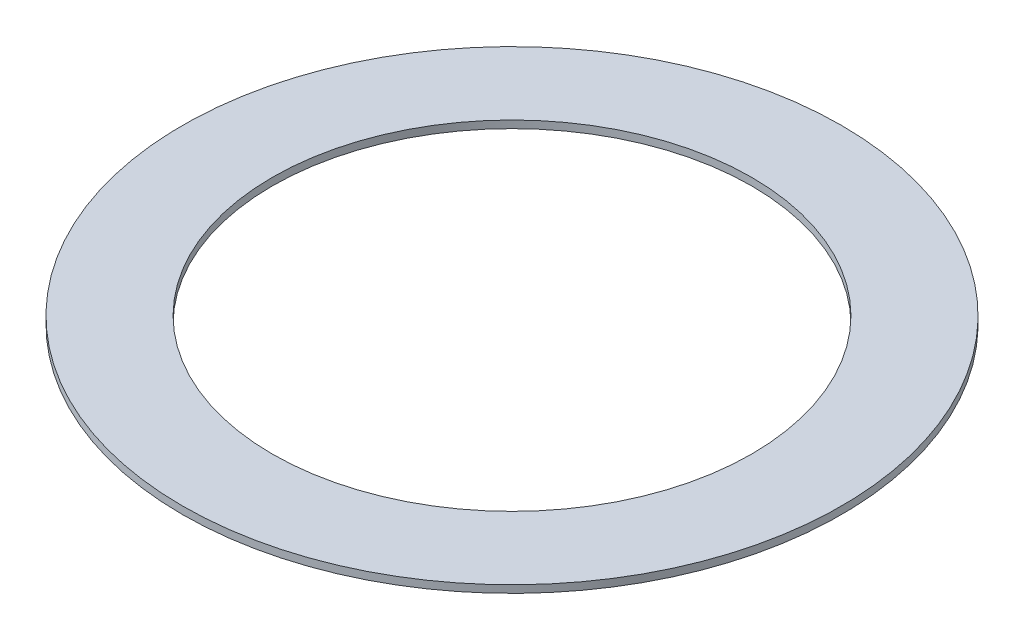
ISO-10303-21;
HEADER;
FILE_DESCRIPTION(('STEP AP214'),'2;1');
FILE_NAME('part.step','',(''),(''),'','','');
FILE_SCHEMA(('AUTOMOTIVE_DESIGN { 1 0 10303 214 1 1 1 1 }'));
ENDSEC;
DATA;
#1=APPLICATION_CONTEXT('core data for automotive mechanical design processes');
#2=APPLICATION_PROTOCOL_DEFINITION('international standard','automotive_design',2000,#1);
#3=PRODUCT_CONTEXT('',#1,'mechanical');
#4=PRODUCT('Part','Part','',(#3));
#5=PRODUCT_RELATED_PRODUCT_CATEGORY('part','',(#4));
#6=PRODUCT_DEFINITION_FORMATION('','',#4);
#7=PRODUCT_DEFINITION_CONTEXT('part definition',#1,'design');
#8=PRODUCT_DEFINITION('design','',#6,#7);
#9=PRODUCT_DEFINITION_SHAPE('','',#8);
#10=(LENGTH_UNIT() NAMED_UNIT(*) SI_UNIT(.MILLI.,.METRE.));
#11=(NAMED_UNIT(*) PLANE_ANGLE_UNIT() SI_UNIT($,.RADIAN.));
#12=(NAMED_UNIT(*) SI_UNIT($,.STERADIAN.) SOLID_ANGLE_UNIT());
#13=UNCERTAINTY_MEASURE_WITH_UNIT(LENGTH_MEASURE(1.E-05),#10,'distance_accuracy_value','');
#14=(GEOMETRIC_REPRESENTATION_CONTEXT(3) GLOBAL_UNCERTAINTY_ASSIGNED_CONTEXT((#13)) GLOBAL_UNIT_ASSIGNED_CONTEXT((#10,
#11,#12)) REPRESENTATION_CONTEXT('',''));
#15=CARTESIAN_POINT('',(0.,0.,0.));
#16=DIRECTION('',(0.,0.,1.));
#17=DIRECTION('',(1.,0.,0.));
#18=AXIS2_PLACEMENT_3D('',#15,#16,#17);
#19=CARTESIAN_POINT('',(0.,0.79375,0.));
#20=DIRECTION('',(0.,1.,0.));
#21=DIRECTION('',(0.,0.,1.));
#22=AXIS2_PLACEMENT_3D('',#19,#20,#21);
#23=PLANE('',#22);
#24=CARTESIAN_POINT('',(0.,0.79375,0.));
#25=DIRECTION('',(0.,1.,0.));
#26=DIRECTION('',(0.,0.,1.));
#27=AXIS2_PLACEMENT_3D('',#24,#25,#26);
#28=CIRCLE('',#27,34.925);
#29=CARTESIAN_POINT('',(0.,0.79375,34.925));
#30=VERTEX_POINT('',#29);
#31=EDGE_CURVE('E10',#30,#30,#28,.T.);
#32=ORIENTED_EDGE('',*,*,#31,.T.);
#33=EDGE_LOOP('',(#32));
#34=FACE_BOUND('',#33,.T.);
#35=CARTESIAN_POINT('',(0.,0.79375,0.));
#36=DIRECTION('',(0.,1.,0.));
#37=DIRECTION('',(0.,0.,1.));
#38=AXIS2_PLACEMENT_3D('',#35,#36,#37);
#39=CIRCLE('',#38,25.4);
#40=CARTESIAN_POINT('',(0.,0.79375,25.4));
#41=VERTEX_POINT('',#40);
#42=EDGE_CURVE('E40',#41,#41,#39,.T.);
#43=ORIENTED_EDGE('',*,*,#42,.F.);
#44=EDGE_LOOP('',(#43));
#45=FACE_BOUND('',#44,.T.);
#46=ADVANCED_FACE('F29',(#34,#45),#23,.T.);
#47=CARTESIAN_POINT('',(0.,0.,0.));
#48=DIRECTION('',(0.,1.,0.));
#49=DIRECTION('',(0.,0.,1.));
#50=AXIS2_PLACEMENT_3D('',#47,#48,#49);
#51=PLANE('',#50);
#52=CARTESIAN_POINT('',(0.,0.,0.));
#53=DIRECTION('',(0.,1.,0.));
#54=DIRECTION('',(0.,0.,1.));
#55=AXIS2_PLACEMENT_3D('',#52,#53,#54);
#56=CIRCLE('',#55,34.925);
#57=CARTESIAN_POINT('',(0.,0.,34.925));
#58=VERTEX_POINT('',#57);
#59=EDGE_CURVE('E33',#58,#58,#56,.T.);
#60=ORIENTED_EDGE('',*,*,#59,.F.);
#61=EDGE_LOOP('',(#60));
#62=FACE_BOUND('',#61,.T.);
#63=CARTESIAN_POINT('',(0.,0.,0.));
#64=DIRECTION('',(0.,1.,0.));
#65=DIRECTION('',(0.,0.,1.));
#66=AXIS2_PLACEMENT_3D('',#63,#64,#65);
#67=CIRCLE('',#66,25.4);
#68=CARTESIAN_POINT('',(0.,0.,25.4));
#69=VERTEX_POINT('',#68);
#70=EDGE_CURVE('E42',#69,#69,#67,.T.);
#71=ORIENTED_EDGE('',*,*,#70,.T.);
#72=EDGE_LOOP('',(#71));
#73=FACE_BOUND('',#72,.T.);
#74=ADVANCED_FACE('F52',(#62,#73),#51,.F.);
#75=CARTESIAN_POINT('',(0.,0.79375,0.));
#76=DIRECTION('',(0.,-1.,0.));
#77=DIRECTION('',(0.,0.,-1.));
#78=AXIS2_PLACEMENT_3D('',#75,#76,#77);
#79=CYLINDRICAL_SURFACE('',#78,34.925);
#80=ORIENTED_EDGE('',*,*,#31,.F.);
#81=EDGE_LOOP('',(#80));
#82=FACE_BOUND('',#81,.T.);
#83=ORIENTED_EDGE('',*,*,#59,.T.);
#84=EDGE_LOOP('',(#83));
#85=FACE_BOUND('',#84,.T.);
#86=ADVANCED_FACE('F31',(#82,#85),#79,.T.);
#87=CARTESIAN_POINT('',(0.,0.79375,0.));
#88=DIRECTION('',(0.,-1.,0.));
#89=DIRECTION('',(0.,0.,-1.));
#90=AXIS2_PLACEMENT_3D('',#87,#88,#89);
#91=CYLINDRICAL_SURFACE('',#90,25.4);
#92=ORIENTED_EDGE('',*,*,#42,.T.);
#93=EDGE_LOOP('',(#92));
#94=FACE_BOUND('',#93,.T.);
#95=ORIENTED_EDGE('',*,*,#70,.F.);
#96=EDGE_LOOP('',(#95));
#97=FACE_BOUND('',#96,.T.);
#98=ADVANCED_FACE('F48',(#94,#97),#91,.F.);
#99=CLOSED_SHELL('',(#46,#74,#86,#98));
#100=MANIFOLD_SOLID_BREP('B2',#99);
#101=ADVANCED_BREP_SHAPE_REPRESENTATION('',(#18,#100),#14);
#102=SHAPE_DEFINITION_REPRESENTATION(#9,#101);
ENDSEC;
END-ISO-10303-21;
